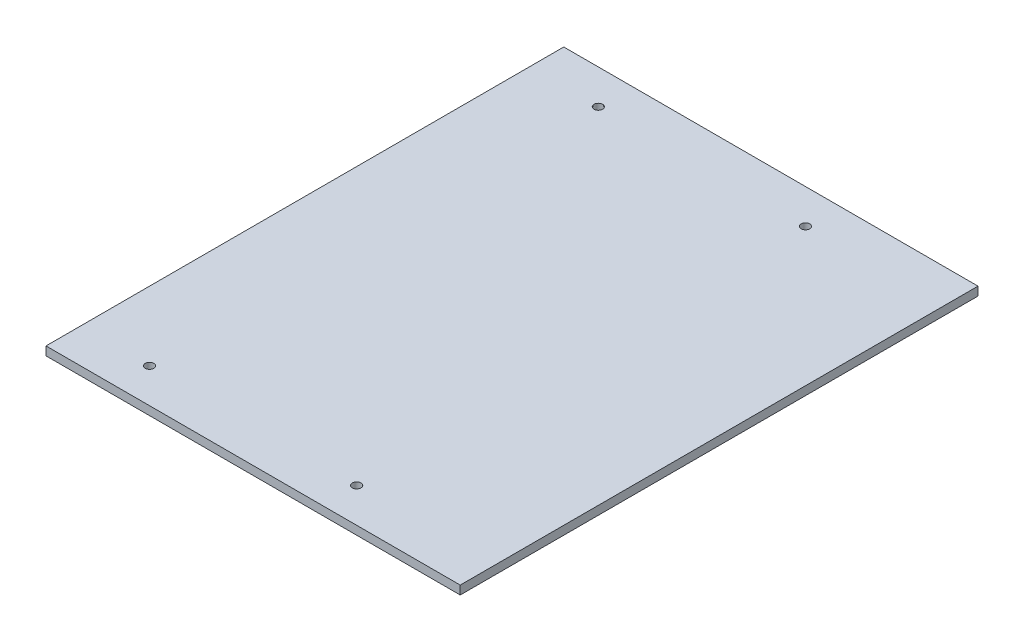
ISO-10303-21;
HEADER;
FILE_DESCRIPTION(('STEP AP214'),'2;1');
FILE_NAME('part.step','',(''),(''),'','','');
FILE_SCHEMA(('AUTOMOTIVE_DESIGN { 1 0 10303 214 1 1 1 1 }'));
ENDSEC;
DATA;
#1=APPLICATION_CONTEXT('core data for automotive mechanical design processes');
#2=APPLICATION_PROTOCOL_DEFINITION('international standard','automotive_design',2000,#1);
#3=PRODUCT_CONTEXT('',#1,'mechanical');
#4=PRODUCT('Part','Part','',(#3));
#5=PRODUCT_RELATED_PRODUCT_CATEGORY('part','',(#4));
#6=PRODUCT_DEFINITION_FORMATION('','',#4);
#7=PRODUCT_DEFINITION_CONTEXT('part definition',#1,'design');
#8=PRODUCT_DEFINITION('design','',#6,#7);
#9=PRODUCT_DEFINITION_SHAPE('','',#8);
#10=(LENGTH_UNIT() NAMED_UNIT(*) SI_UNIT(.MILLI.,.METRE.));
#11=(NAMED_UNIT(*) PLANE_ANGLE_UNIT() SI_UNIT($,.RADIAN.));
#12=(NAMED_UNIT(*) SI_UNIT($,.STERADIAN.) SOLID_ANGLE_UNIT());
#13=UNCERTAINTY_MEASURE_WITH_UNIT(LENGTH_MEASURE(1.E-05),#10,'distance_accuracy_value','');
#14=(GEOMETRIC_REPRESENTATION_CONTEXT(3) GLOBAL_UNCERTAINTY_ASSIGNED_CONTEXT((#13)) GLOBAL_UNIT_ASSIGNED_CONTEXT((#10,
#11,#12)) REPRESENTATION_CONTEXT('',''));
#15=CARTESIAN_POINT('',(0.,0.,0.));
#16=DIRECTION('',(0.,0.,1.));
#17=DIRECTION('',(1.,0.,0.));
#18=AXIS2_PLACEMENT_3D('',#15,#16,#17);
#19=CARTESIAN_POINT('',(0.,3.175,0.));
#20=DIRECTION('',(0.,1.,0.));
#21=DIRECTION('',(0.,0.,1.));
#22=AXIS2_PLACEMENT_3D('',#19,#20,#21);
#23=PLANE('',#22);
#24=CARTESIAN_POINT('',(-76.2,3.175,-82.5499999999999));
#25=DIRECTION('',(0.,1.,0.));
#26=DIRECTION('',(0.,0.,1.));
#27=AXIS2_PLACEMENT_3D('',#24,#25,#26);
#28=CIRCLE('',#27,1.58749999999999);
#29=CARTESIAN_POINT('',(-76.2,3.175,-80.9624999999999));
#30=VERTEX_POINT('',#29);
#31=EDGE_CURVE('E142',#30,#30,#28,.T.);
#32=ORIENTED_EDGE('',*,*,#31,.F.);
#33=EDGE_LOOP('',(#32));
#34=FACE_BOUND('',#33,.T.);
#35=CARTESIAN_POINT('',(0.,3.175,82.55));
#36=DIRECTION('',(0.,1.,0.));
#37=DIRECTION('',(0.,0.,1.));
#38=AXIS2_PLACEMENT_3D('',#35,#36,#37);
#39=CIRCLE('',#38,1.5875);
#40=CARTESIAN_POINT('',(0.,3.175,84.1375));
#41=VERTEX_POINT('',#40);
#42=EDGE_CURVE('E112',#41,#41,#39,.T.);
#43=ORIENTED_EDGE('',*,*,#42,.F.);
#44=EDGE_LOOP('',(#43));
#45=FACE_BOUND('',#44,.T.);
#46=DIRECTION('',(0.,0.,1.));
#47=VECTOR('',#46,1.);
#48=CARTESIAN_POINT('',(-101.6,3.175,95.25));
#49=LINE('',#48,#47);
#50=CARTESIAN_POINT('',(-101.6,3.175,-95.25));
#51=VERTEX_POINT('',#50);
#52=CARTESIAN_POINT('',(-101.6,3.175,95.25));
#53=VERTEX_POINT('',#52);
#54=EDGE_CURVE('E92',#51,#53,#49,.T.);
#55=ORIENTED_EDGE('',*,*,#54,.T.);
#56=DIRECTION('',(1.,0.,0.));
#57=VECTOR('',#56,1.);
#58=CARTESIAN_POINT('',(50.8000000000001,3.175,95.25));
#59=LINE('',#58,#57);
#60=CARTESIAN_POINT('',(50.8000000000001,3.175,95.25));
#61=VERTEX_POINT('',#60);
#62=EDGE_CURVE('E87',#53,#61,#59,.T.);
#63=ORIENTED_EDGE('',*,*,#62,.T.);
#64=DIRECTION('',(0.,0.,-1.));
#65=VECTOR('',#64,1.);
#66=CARTESIAN_POINT('',(50.8000000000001,3.175,-95.25));
#67=LINE('',#66,#65);
#68=CARTESIAN_POINT('',(50.8000000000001,3.175,-95.25));
#69=VERTEX_POINT('',#68);
#70=EDGE_CURVE('E90',#61,#69,#67,.T.);
#71=ORIENTED_EDGE('',*,*,#70,.T.);
#72=DIRECTION('',(-1.,0.,0.));
#73=VECTOR('',#72,1.);
#74=CARTESIAN_POINT('',(50.8000000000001,3.175,-95.25));
#75=LINE('',#74,#73);
#76=EDGE_CURVE('E57',#69,#51,#75,.T.);
#77=ORIENTED_EDGE('',*,*,#76,.T.);
#78=EDGE_LOOP('',(#55,#63,#71,#77));
#79=FACE_BOUND('',#78,.T.);
#80=CARTESIAN_POINT('',(-76.2,3.175,82.55));
#81=DIRECTION('',(0.,1.,0.));
#82=DIRECTION('',(0.,0.,1.));
#83=AXIS2_PLACEMENT_3D('',#80,#81,#82);
#84=CIRCLE('',#83,1.58749999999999);
#85=CARTESIAN_POINT('',(-76.2,3.175,84.1375));
#86=VERTEX_POINT('',#85);
#87=EDGE_CURVE('E134',#86,#86,#84,.T.);
#88=ORIENTED_EDGE('',*,*,#87,.F.);
#89=EDGE_LOOP('',(#88));
#90=FACE_BOUND('',#89,.T.);
#91=CARTESIAN_POINT('',(0.,3.175,-82.55));
#92=DIRECTION('',(0.,1.,0.));
#93=DIRECTION('',(0.,0.,1.));
#94=AXIS2_PLACEMENT_3D('',#91,#92,#93);
#95=CIRCLE('',#94,1.5875);
#96=CARTESIAN_POINT('',(0.,3.175,-80.9624999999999));
#97=VERTEX_POINT('',#96);
#98=EDGE_CURVE('E150',#97,#97,#95,.T.);
#99=ORIENTED_EDGE('',*,*,#98,.F.);
#100=EDGE_LOOP('',(#99));
#101=FACE_BOUND('',#100,.T.);
#102=ADVANCED_FACE('F39',(#34,#45,#79,#90,#101),#23,.T.);
#103=CARTESIAN_POINT('',(0.,0.,0.));
#104=DIRECTION('',(0.,1.,0.));
#105=DIRECTION('',(0.,0.,1.));
#106=AXIS2_PLACEMENT_3D('',#103,#104,#105);
#107=PLANE('',#106);
#108=DIRECTION('',(0.,0.,1.));
#109=VECTOR('',#108,1.);
#110=CARTESIAN_POINT('',(-101.6,0.,95.25));
#111=LINE('',#110,#109);
#112=CARTESIAN_POINT('',(-101.6,0.,-95.25));
#113=VERTEX_POINT('',#112);
#114=CARTESIAN_POINT('',(-101.6,0.,95.25));
#115=VERTEX_POINT('',#114);
#116=EDGE_CURVE('E108',#113,#115,#111,.T.);
#117=ORIENTED_EDGE('',*,*,#116,.F.);
#118=DIRECTION('',(-1.,0.,0.));
#119=VECTOR('',#118,1.);
#120=CARTESIAN_POINT('',(50.8000000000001,0.,-95.25));
#121=LINE('',#120,#119);
#122=CARTESIAN_POINT('',(50.8000000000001,0.,-95.25));
#123=VERTEX_POINT('',#122);
#124=EDGE_CURVE('E80',#123,#113,#121,.T.);
#125=ORIENTED_EDGE('',*,*,#124,.F.);
#126=DIRECTION('',(0.,0.,-1.));
#127=VECTOR('',#126,1.);
#128=CARTESIAN_POINT('',(50.8000000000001,0.,-95.25));
#129=LINE('',#128,#127);
#130=CARTESIAN_POINT('',(50.8000000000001,0.,95.25));
#131=VERTEX_POINT('',#130);
#132=EDGE_CURVE('E74',#131,#123,#129,.T.);
#133=ORIENTED_EDGE('',*,*,#132,.F.);
#134=DIRECTION('',(1.,0.,0.));
#135=VECTOR('',#134,1.);
#136=CARTESIAN_POINT('',(50.8000000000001,0.,95.25));
#137=LINE('',#136,#135);
#138=EDGE_CURVE('E97',#115,#131,#137,.T.);
#139=ORIENTED_EDGE('',*,*,#138,.F.);
#140=EDGE_LOOP('',(#117,#125,#133,#139));
#141=FACE_BOUND('',#140,.T.);
#142=CARTESIAN_POINT('',(0.,0.,82.55));
#143=DIRECTION('',(0.,1.,0.));
#144=DIRECTION('',(0.,0.,1.));
#145=AXIS2_PLACEMENT_3D('',#142,#143,#144);
#146=CIRCLE('',#145,1.5875);
#147=CARTESIAN_POINT('',(0.,0.,84.1375));
#148=VERTEX_POINT('',#147);
#149=EDGE_CURVE('E130',#148,#148,#146,.T.);
#150=ORIENTED_EDGE('',*,*,#149,.T.);
#151=EDGE_LOOP('',(#150));
#152=FACE_BOUND('',#151,.T.);
#153=CARTESIAN_POINT('',(-76.2,0.,82.55));
#154=DIRECTION('',(0.,1.,0.));
#155=DIRECTION('',(0.,0.,1.));
#156=AXIS2_PLACEMENT_3D('',#153,#154,#155);
#157=CIRCLE('',#156,1.58749999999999);
#158=CARTESIAN_POINT('',(-76.2,0.,84.1375));
#159=VERTEX_POINT('',#158);
#160=EDGE_CURVE('E138',#159,#159,#157,.T.);
#161=ORIENTED_EDGE('',*,*,#160,.T.);
#162=EDGE_LOOP('',(#161));
#163=FACE_BOUND('',#162,.T.);
#164=CARTESIAN_POINT('',(-76.2,0.,-82.5499999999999));
#165=DIRECTION('',(0.,1.,0.));
#166=DIRECTION('',(0.,0.,1.));
#167=AXIS2_PLACEMENT_3D('',#164,#165,#166);
#168=CIRCLE('',#167,1.58749999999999);
#169=CARTESIAN_POINT('',(-76.2,0.,-80.9624999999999));
#170=VERTEX_POINT('',#169);
#171=EDGE_CURVE('E146',#170,#170,#168,.T.);
#172=ORIENTED_EDGE('',*,*,#171,.T.);
#173=EDGE_LOOP('',(#172));
#174=FACE_BOUND('',#173,.T.);
#175=CARTESIAN_POINT('',(0.,0.,-82.55));
#176=DIRECTION('',(0.,1.,0.));
#177=DIRECTION('',(0.,0.,1.));
#178=AXIS2_PLACEMENT_3D('',#175,#176,#177);
#179=CIRCLE('',#178,1.5875);
#180=CARTESIAN_POINT('',(0.,0.,-80.9624999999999));
#181=VERTEX_POINT('',#180);
#182=EDGE_CURVE('E154',#181,#181,#179,.T.);
#183=ORIENTED_EDGE('',*,*,#182,.T.);
#184=EDGE_LOOP('',(#183));
#185=FACE_BOUND('',#184,.T.);
#186=ADVANCED_FACE('F125',(#141,#152,#163,#174,#185),#107,.F.);
#187=CARTESIAN_POINT('',(-101.6,3.175,95.25));
#188=DIRECTION('',(1.,0.,0.));
#189=DIRECTION('',(0.,0.,-1.));
#190=AXIS2_PLACEMENT_3D('',#187,#188,#189);
#191=PLANE('',#190);
#192=ORIENTED_EDGE('',*,*,#116,.T.);
#193=DIRECTION('',(0.,-1.,0.));
#194=VECTOR('',#193,1.);
#195=CARTESIAN_POINT('',(-101.6,3.175,95.25));
#196=LINE('',#195,#194);
#197=EDGE_CURVE('E11',#53,#115,#196,.T.);
#198=ORIENTED_EDGE('',*,*,#197,.F.);
#199=ORIENTED_EDGE('',*,*,#54,.F.);
#200=DIRECTION('',(0.,-1.,0.));
#201=VECTOR('',#200,1.);
#202=CARTESIAN_POINT('',(-101.6,3.175,-95.25));
#203=LINE('',#202,#201);
#204=EDGE_CURVE('E104',#51,#113,#203,.T.);
#205=ORIENTED_EDGE('',*,*,#204,.T.);
#206=EDGE_LOOP('',(#192,#198,#199,#205));
#207=FACE_BOUND('',#206,.T.);
#208=ADVANCED_FACE('F41',(#207),#191,.F.);
#209=CARTESIAN_POINT('',(50.8000000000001,3.175,95.25));
#210=DIRECTION('',(0.,0.,-1.));
#211=DIRECTION('',(-1.,0.,0.));
#212=AXIS2_PLACEMENT_3D('',#209,#210,#211);
#213=PLANE('',#212);
#214=ORIENTED_EDGE('',*,*,#138,.T.);
#215=DIRECTION('',(0.,-1.,0.));
#216=VECTOR('',#215,1.);
#217=CARTESIAN_POINT('',(50.8000000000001,3.175,95.25));
#218=LINE('',#217,#216);
#219=EDGE_CURVE('E49',#61,#131,#218,.T.);
#220=ORIENTED_EDGE('',*,*,#219,.F.);
#221=ORIENTED_EDGE('',*,*,#62,.F.);
#222=ORIENTED_EDGE('',*,*,#197,.T.);
#223=EDGE_LOOP('',(#214,#220,#221,#222));
#224=FACE_BOUND('',#223,.T.);
#225=ADVANCED_FACE('F96',(#224),#213,.F.);
#226=CARTESIAN_POINT('',(50.8000000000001,3.175,-95.25));
#227=DIRECTION('',(-1.,0.,0.));
#228=DIRECTION('',(0.,0.,1.));
#229=AXIS2_PLACEMENT_3D('',#226,#227,#228);
#230=PLANE('',#229);
#231=ORIENTED_EDGE('',*,*,#132,.T.);
#232=DIRECTION('',(0.,-1.,0.));
#233=VECTOR('',#232,1.);
#234=CARTESIAN_POINT('',(50.8000000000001,3.175,-95.25));
#235=LINE('',#234,#233);
#236=EDGE_CURVE('E99',#69,#123,#235,.T.);
#237=ORIENTED_EDGE('',*,*,#236,.F.);
#238=ORIENTED_EDGE('',*,*,#70,.F.);
#239=ORIENTED_EDGE('',*,*,#219,.T.);
#240=EDGE_LOOP('',(#231,#237,#238,#239));
#241=FACE_BOUND('',#240,.T.);
#242=ADVANCED_FACE('F100',(#241),#230,.F.);
#243=CARTESIAN_POINT('',(50.8000000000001,3.175,-95.25));
#244=DIRECTION('',(0.,0.,1.));
#245=DIRECTION('',(1.,0.,0.));
#246=AXIS2_PLACEMENT_3D('',#243,#244,#245);
#247=PLANE('',#246);
#248=ORIENTED_EDGE('',*,*,#124,.T.);
#249=ORIENTED_EDGE('',*,*,#204,.F.);
#250=ORIENTED_EDGE('',*,*,#76,.F.);
#251=ORIENTED_EDGE('',*,*,#236,.T.);
#252=EDGE_LOOP('',(#248,#249,#250,#251));
#253=FACE_BOUND('',#252,.T.);
#254=ADVANCED_FACE('F122',(#253),#247,.F.);
#255=CARTESIAN_POINT('',(0.,3.175,82.55));
#256=DIRECTION('',(0.,-1.,0.));
#257=DIRECTION('',(0.,0.,-1.));
#258=AXIS2_PLACEMENT_3D('',#255,#256,#257);
#259=CYLINDRICAL_SURFACE('',#258,1.5875);
#260=ORIENTED_EDGE('',*,*,#42,.T.);
#261=EDGE_LOOP('',(#260));
#262=FACE_BOUND('',#261,.T.);
#263=ORIENTED_EDGE('',*,*,#149,.F.);
#264=EDGE_LOOP('',(#263));
#265=FACE_BOUND('',#264,.T.);
#266=ADVANCED_FACE('F175',(#262,#265),#259,.F.);
#267=CARTESIAN_POINT('',(-76.2,3.175,82.55));
#268=DIRECTION('',(0.,-1.,0.));
#269=DIRECTION('',(0.,0.,-1.));
#270=AXIS2_PLACEMENT_3D('',#267,#268,#269);
#271=CYLINDRICAL_SURFACE('',#270,1.58749999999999);
#272=ORIENTED_EDGE('',*,*,#87,.T.);
#273=EDGE_LOOP('',(#272));
#274=FACE_BOUND('',#273,.T.);
#275=ORIENTED_EDGE('',*,*,#160,.F.);
#276=EDGE_LOOP('',(#275));
#277=FACE_BOUND('',#276,.T.);
#278=ADVANCED_FACE('F221',(#274,#277),#271,.F.);
#279=CARTESIAN_POINT('',(-76.2,3.175,-82.5499999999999));
#280=DIRECTION('',(0.,-1.,0.));
#281=DIRECTION('',(0.,0.,-1.));
#282=AXIS2_PLACEMENT_3D('',#279,#280,#281);
#283=CYLINDRICAL_SURFACE('',#282,1.58749999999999);
#284=ORIENTED_EDGE('',*,*,#31,.T.);
#285=EDGE_LOOP('',(#284));
#286=FACE_BOUND('',#285,.T.);
#287=ORIENTED_EDGE('',*,*,#171,.F.);
#288=EDGE_LOOP('',(#287));
#289=FACE_BOUND('',#288,.T.);
#290=ADVANCED_FACE('F229',(#286,#289),#283,.F.);
#291=CARTESIAN_POINT('',(0.,3.175,-82.55));
#292=DIRECTION('',(0.,-1.,0.));
#293=DIRECTION('',(0.,0.,-1.));
#294=AXIS2_PLACEMENT_3D('',#291,#292,#293);
#295=CYLINDRICAL_SURFACE('',#294,1.5875);
#296=ORIENTED_EDGE('',*,*,#98,.T.);
#297=EDGE_LOOP('',(#296));
#298=FACE_BOUND('',#297,.T.);
#299=ORIENTED_EDGE('',*,*,#182,.F.);
#300=EDGE_LOOP('',(#299));
#301=FACE_BOUND('',#300,.T.);
#302=ADVANCED_FACE('F162',(#298,#301),#295,.F.);
#303=CLOSED_SHELL('',(#102,#186,#208,#225,#242,#254,#266,#278,#290,#302));
#304=MANIFOLD_SOLID_BREP('B2',#303);
#305=ADVANCED_BREP_SHAPE_REPRESENTATION('',(#18,#304),#14);
#306=SHAPE_DEFINITION_REPRESENTATION(#9,#305);
ENDSEC;
END-ISO-10303-21;
